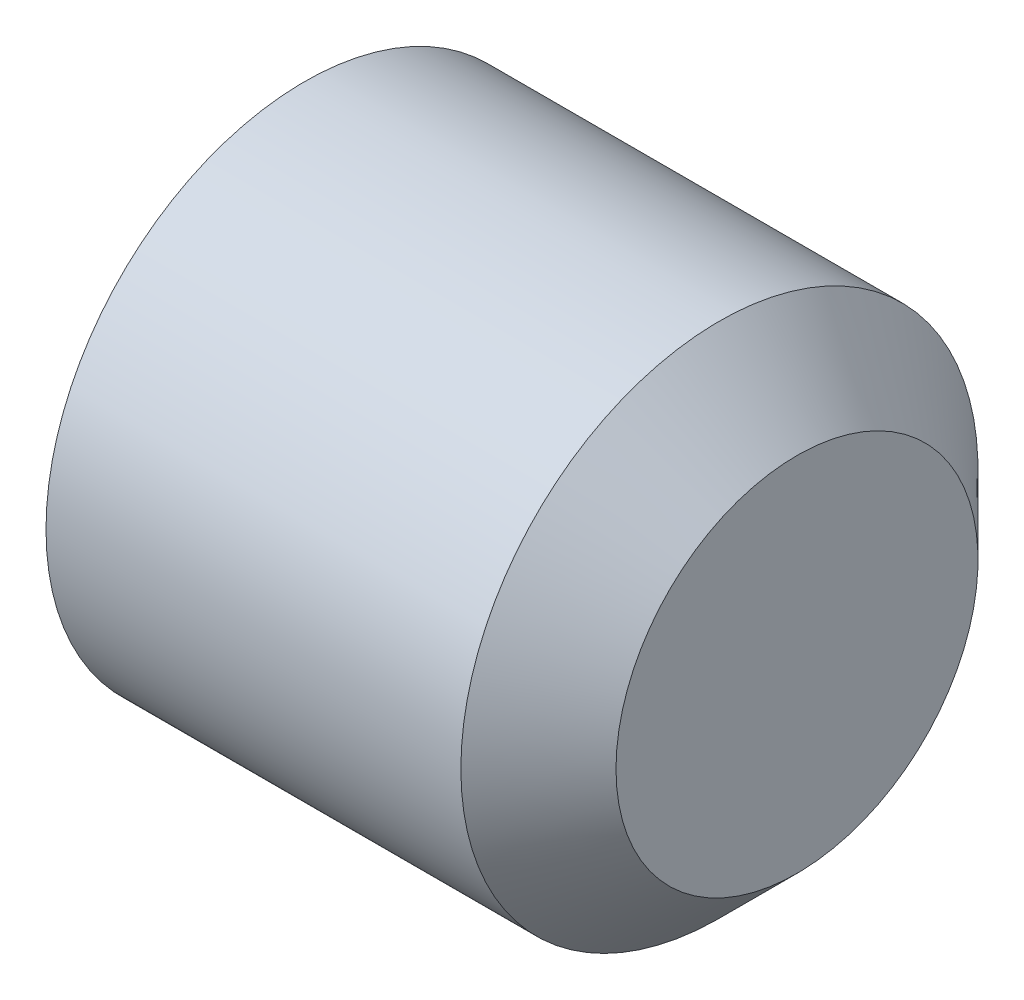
ISO-10303-21;
HEADER;
FILE_DESCRIPTION(('STEP AP214'),'2;1');
FILE_NAME('part.step','',(''),(''),'','','');
FILE_SCHEMA(('AUTOMOTIVE_DESIGN { 1 0 10303 214 1 1 1 1 }'));
ENDSEC;
DATA;
#1=APPLICATION_CONTEXT('core data for automotive mechanical design processes');
#2=APPLICATION_PROTOCOL_DEFINITION('international standard','automotive_design',2000,#1);
#3=PRODUCT_CONTEXT('',#1,'mechanical');
#4=PRODUCT('Part','Part','',(#3));
#5=PRODUCT_RELATED_PRODUCT_CATEGORY('part','',(#4));
#6=PRODUCT_DEFINITION_FORMATION('','',#4);
#7=PRODUCT_DEFINITION_CONTEXT('part definition',#1,'design');
#8=PRODUCT_DEFINITION('design','',#6,#7);
#9=PRODUCT_DEFINITION_SHAPE('','',#8);
#10=(LENGTH_UNIT() NAMED_UNIT(*) SI_UNIT(.MILLI.,.METRE.));
#11=(NAMED_UNIT(*) PLANE_ANGLE_UNIT() SI_UNIT($,.RADIAN.));
#12=(NAMED_UNIT(*) SI_UNIT($,.STERADIAN.) SOLID_ANGLE_UNIT());
#13=UNCERTAINTY_MEASURE_WITH_UNIT(LENGTH_MEASURE(1.E-05),#10,'distance_accuracy_value','');
#14=(GEOMETRIC_REPRESENTATION_CONTEXT(3) GLOBAL_UNCERTAINTY_ASSIGNED_CONTEXT((#13)) GLOBAL_UNIT_ASSIGNED_CONTEXT((#10,
#11,#12)) REPRESENTATION_CONTEXT('',''));
#15=CARTESIAN_POINT('',(0.,0.,0.));
#16=DIRECTION('',(0.,0.,1.));
#17=DIRECTION('',(1.,0.,0.));
#18=AXIS2_PLACEMENT_3D('',#15,#16,#17);
#19=CARTESIAN_POINT('',(0.,0.,0.));
#20=DIRECTION('',(-1.,0.,0.));
#21=DIRECTION('',(0.,0.,1.));
#22=AXIS2_PLACEMENT_3D('',#19,#20,#21);
#23=PLANE('',#22);
#24=CARTESIAN_POINT('',(0.,0.,0.));
#25=DIRECTION('',(-1.,0.,0.));
#26=DIRECTION('',(0.,0.,1.));
#27=AXIS2_PLACEMENT_3D('',#24,#25,#26);
#28=CIRCLE('',#27,4.172);
#29=CARTESIAN_POINT('',(0.,0.,4.17200000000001));
#30=VERTEX_POINT('',#29);
#31=EDGE_CURVE('E87',#30,#30,#28,.T.);
#32=ORIENTED_EDGE('',*,*,#31,.T.);
#33=EDGE_LOOP('',(#32));
#34=FACE_BOUND('',#33,.T.);
#35=DIRECTION('',(0.,0.,-1.));
#36=VECTOR('',#35,1.);
#37=CARTESIAN_POINT('',(0.,2.50000000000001,1.44337567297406));
#38=LINE('',#37,#36);
#39=CARTESIAN_POINT('',(0.,2.50000000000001,1.44337567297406));
#40=VERTEX_POINT('',#39);
#41=CARTESIAN_POINT('',(0.,2.50000000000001,-1.44337567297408));
#42=VERTEX_POINT('',#41);
#43=EDGE_CURVE('E101',#40,#42,#38,.T.);
#44=ORIENTED_EDGE('',*,*,#43,.F.);
#45=DIRECTION('',(0.,-0.866025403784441,0.500000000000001));
#46=VECTOR('',#45,1.);
#47=CARTESIAN_POINT('',(0.,2.50000000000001,1.44337567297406));
#48=LINE('',#47,#46);
#49=CARTESIAN_POINT('',(0.,0.,2.88675134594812));
#50=VERTEX_POINT('',#49);
#51=EDGE_CURVE('E46',#40,#50,#48,.T.);
#52=ORIENTED_EDGE('',*,*,#51,.T.);
#53=DIRECTION('',(0.,0.86602540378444,0.500000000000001));
#54=VECTOR('',#53,1.);
#55=CARTESIAN_POINT('',(0.,-2.5,1.44337567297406));
#56=LINE('',#55,#54);
#57=CARTESIAN_POINT('',(0.,-2.5,1.44337567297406));
#58=VERTEX_POINT('',#57);
#59=EDGE_CURVE('E91',#58,#50,#56,.T.);
#60=ORIENTED_EDGE('',*,*,#59,.F.);
#61=DIRECTION('',(0.,0.,-1.));
#62=VECTOR('',#61,1.);
#63=CARTESIAN_POINT('',(0.,-2.5,1.44337567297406));
#64=LINE('',#63,#62);
#65=CARTESIAN_POINT('',(0.,-2.5,-1.44337567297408));
#66=VERTEX_POINT('',#65);
#67=EDGE_CURVE('E96',#58,#66,#64,.T.);
#68=ORIENTED_EDGE('',*,*,#67,.T.);
#69=DIRECTION('',(0.,0.86602540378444,-0.500000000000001));
#70=VECTOR('',#69,1.);
#71=CARTESIAN_POINT('',(0.,-2.5,-1.44337567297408));
#72=LINE('',#71,#70);
#73=CARTESIAN_POINT('',(0.,0.,-2.88675134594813));
#74=VERTEX_POINT('',#73);
#75=EDGE_CURVE('E105',#66,#74,#72,.T.);
#76=ORIENTED_EDGE('',*,*,#75,.T.);
#77=DIRECTION('',(0.,-0.86602540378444,-0.500000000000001));
#78=VECTOR('',#77,1.);
#79=CARTESIAN_POINT('',(0.,2.50000000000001,-1.44337567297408));
#80=LINE('',#79,#78);
#81=EDGE_CURVE('E108',#42,#74,#80,.T.);
#82=ORIENTED_EDGE('',*,*,#81,.F.);
#83=EDGE_LOOP('',(#44,#52,#60,#68,#76,#82));
#84=FACE_BOUND('',#83,.T.);
#85=ADVANCED_FACE('F31',(#34,#84),#23,.T.);
#86=CARTESIAN_POINT('',(10.,3.5,0.));
#87=DIRECTION('',(1.,0.,0.));
#88=DIRECTION('',(0.,0.,-1.));
#89=AXIS2_PLACEMENT_3D('',#86,#87,#88);
#90=PLANE('',#89);
#91=CARTESIAN_POINT('',(10.,0.,0.));
#92=DIRECTION('',(-1.,0.,0.));
#93=DIRECTION('',(0.,0.,1.));
#94=AXIS2_PLACEMENT_3D('',#91,#92,#93);
#95=CIRCLE('',#94,3.5);
#96=CARTESIAN_POINT('',(10.,0.,3.5));
#97=VERTEX_POINT('',#96);
#98=EDGE_CURVE('E11',#97,#97,#95,.T.);
#99=ORIENTED_EDGE('',*,*,#98,.F.);
#100=EDGE_LOOP('',(#99));
#101=FACE_BOUND('',#100,.T.);
#102=ADVANCED_FACE('F33',(#101),#90,.T.);
#103=CARTESIAN_POINT('',(8.50000000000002,0.,0.));
#104=DIRECTION('',(-1.,0.,0.));
#105=DIRECTION('',(0.,0.,1.));
#106=AXIS2_PLACEMENT_3D('',#103,#104,#105);
#107=CONICAL_SURFACE('',#106,5.,0.785398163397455);
#108=ORIENTED_EDGE('',*,*,#98,.T.);
#109=EDGE_LOOP('',(#108));
#110=FACE_BOUND('',#109,.T.);
#111=CARTESIAN_POINT('',(8.50000000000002,0.,0.));
#112=DIRECTION('',(-1.,0.,0.));
#113=DIRECTION('',(0.,0.,1.));
#114=AXIS2_PLACEMENT_3D('',#111,#112,#113);
#115=CIRCLE('',#114,5.);
#116=CARTESIAN_POINT('',(8.50000000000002,0.,5.));
#117=VERTEX_POINT('',#116);
#118=EDGE_CURVE('E39',#117,#117,#115,.T.);
#119=ORIENTED_EDGE('',*,*,#118,.F.);
#120=EDGE_LOOP('',(#119));
#121=FACE_BOUND('',#120,.T.);
#122=ADVANCED_FACE('F143',(#110,#121),#107,.T.);
#123=CARTESIAN_POINT('',(-12.7,0.,0.));
#124=DIRECTION('',(-1.,0.,0.));
#125=DIRECTION('',(0.,0.,1.));
#126=AXIS2_PLACEMENT_3D('',#123,#124,#125);
#127=CYLINDRICAL_SURFACE('',#126,5.);
#128=ORIENTED_EDGE('',*,*,#118,.T.);
#129=EDGE_LOOP('',(#128));
#130=FACE_BOUND('',#129,.T.);
#131=CARTESIAN_POINT('',(0.478046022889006,0.,0.));
#132=DIRECTION('',(-1.,0.,0.));
#133=DIRECTION('',(0.,0.,1.));
#134=AXIS2_PLACEMENT_3D('',#131,#132,#133);
#135=CIRCLE('',#134,5.);
#136=CARTESIAN_POINT('',(0.478046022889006,0.,5.00000000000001));
#137=VERTEX_POINT('',#136);
#138=EDGE_CURVE('E135',#137,#137,#135,.T.);
#139=ORIENTED_EDGE('',*,*,#138,.F.);
#140=EDGE_LOOP('',(#139));
#141=FACE_BOUND('',#140,.T.);
#142=ADVANCED_FACE('F140',(#130,#141),#127,.T.);
#143=CARTESIAN_POINT('',(0.,0.,0.));
#144=DIRECTION('',(1.,0.,0.));
#145=DIRECTION('',(0.,0.,-1.));
#146=AXIS2_PLACEMENT_3D('',#143,#144,#145);
#147=CONICAL_SURFACE('',#146,4.172,1.0471975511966);
#148=ORIENTED_EDGE('',*,*,#138,.T.);
#149=EDGE_LOOP('',(#148));
#150=FACE_BOUND('',#149,.T.);
#151=ORIENTED_EDGE('',*,*,#31,.F.);
#152=EDGE_LOOP('',(#151));
#153=FACE_BOUND('',#152,.T.);
#154=ADVANCED_FACE('F150',(#150,#153),#147,.T.);
#155=CARTESIAN_POINT('',(5.,2.5,1.44337567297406));
#156=DIRECTION('',(0.,-0.500000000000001,-0.86602540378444));
#157=DIRECTION('',(0.,0.866025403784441,-0.500000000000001));
#158=AXIS2_PLACEMENT_3D('',#155,#156,#157);
#159=PLANE('',#158);
#160=ORIENTED_EDGE('',*,*,#51,.F.);
#161=DIRECTION('',(-1.,0.,0.));
#162=VECTOR('',#161,1.);
#163=CARTESIAN_POINT('',(5.,2.5,1.44337567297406));
#164=LINE('',#163,#162);
#165=CARTESIAN_POINT('',(5.,2.5,1.44337567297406));
#166=VERTEX_POINT('',#165);
#167=EDGE_CURVE('E50',#166,#40,#164,.T.);
#168=ORIENTED_EDGE('',*,*,#167,.F.);
#169=DIRECTION('',(0.,-0.866025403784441,0.500000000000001));
#170=VECTOR('',#169,1.);
#171=CARTESIAN_POINT('',(5.,2.5,1.44337567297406));
#172=LINE('',#171,#170);
#173=CARTESIAN_POINT('',(5.,0.,2.88675134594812));
#174=VERTEX_POINT('',#173);
#175=EDGE_CURVE('E83',#166,#174,#172,.T.);
#176=ORIENTED_EDGE('',*,*,#175,.T.);
#177=DIRECTION('',(-1.,0.,0.));
#178=VECTOR('',#177,1.);
#179=CARTESIAN_POINT('',(5.,0.,2.88675134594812));
#180=LINE('',#179,#178);
#181=EDGE_CURVE('E80',#174,#50,#180,.T.);
#182=ORIENTED_EDGE('',*,*,#181,.T.);
#183=EDGE_LOOP('',(#160,#168,#176,#182));
#184=FACE_BOUND('',#183,.T.);
#185=ADVANCED_FACE('F82',(#184),#159,.T.);
#186=CARTESIAN_POINT('',(5.,-2.50000000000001,1.44337567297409));
#187=DIRECTION('',(0.,-0.500000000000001,0.86602540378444));
#188=DIRECTION('',(0.,-0.86602540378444,-0.500000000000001));
#189=AXIS2_PLACEMENT_3D('',#186,#187,#188);
#190=PLANE('',#189);
#191=ORIENTED_EDGE('',*,*,#59,.T.);
#192=ORIENTED_EDGE('',*,*,#181,.F.);
#193=DIRECTION('',(0.,0.86602540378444,0.500000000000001));
#194=VECTOR('',#193,1.);
#195=CARTESIAN_POINT('',(5.,-2.50000000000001,1.44337567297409));
#196=LINE('',#195,#194);
#197=CARTESIAN_POINT('',(5.,-2.50000000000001,1.44337567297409));
#198=VERTEX_POINT('',#197);
#199=EDGE_CURVE('E113',#198,#174,#196,.T.);
#200=ORIENTED_EDGE('',*,*,#199,.F.);
#201=DIRECTION('',(-1.,0.,0.));
#202=VECTOR('',#201,1.);
#203=CARTESIAN_POINT('',(5.,-2.50000000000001,1.44337567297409));
#204=LINE('',#203,#202);
#205=EDGE_CURVE('E88',#198,#58,#204,.T.);
#206=ORIENTED_EDGE('',*,*,#205,.T.);
#207=EDGE_LOOP('',(#191,#192,#200,#206));
#208=FACE_BOUND('',#207,.T.);
#209=ADVANCED_FACE('F92',(#208),#190,.F.);
#210=CARTESIAN_POINT('',(5.,-2.50000000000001,1.44337567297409));
#211=DIRECTION('',(0.,1.,0.));
#212=DIRECTION('',(0.,0.,1.));
#213=AXIS2_PLACEMENT_3D('',#210,#211,#212);
#214=PLANE('',#213);
#215=ORIENTED_EDGE('',*,*,#67,.F.);
#216=ORIENTED_EDGE('',*,*,#205,.F.);
#217=DIRECTION('',(0.,0.,-1.));
#218=VECTOR('',#217,1.);
#219=CARTESIAN_POINT('',(5.,-2.50000000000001,1.44337567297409));
#220=LINE('',#219,#218);
#221=CARTESIAN_POINT('',(4.99999999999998,-2.50000000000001,-1.44337567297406));
#222=VERTEX_POINT('',#221);
#223=EDGE_CURVE('E115',#198,#222,#220,.T.);
#224=ORIENTED_EDGE('',*,*,#223,.T.);
#225=DIRECTION('',(-1.,0.,0.));
#226=VECTOR('',#225,1.);
#227=CARTESIAN_POINT('',(4.99999999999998,-2.50000000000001,-1.44337567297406));
#228=LINE('',#227,#226);
#229=EDGE_CURVE('E130',#222,#66,#228,.T.);
#230=ORIENTED_EDGE('',*,*,#229,.T.);
#231=EDGE_LOOP('',(#215,#216,#224,#230));
#232=FACE_BOUND('',#231,.T.);
#233=ADVANCED_FACE('F172',(#232),#214,.T.);
#234=CARTESIAN_POINT('',(4.99999999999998,-2.50000000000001,-1.44337567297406));
#235=DIRECTION('',(0.,0.500000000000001,0.86602540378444));
#236=DIRECTION('',(0.,-0.86602540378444,0.500000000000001));
#237=AXIS2_PLACEMENT_3D('',#234,#235,#236);
#238=PLANE('',#237);
#239=ORIENTED_EDGE('',*,*,#75,.F.);
#240=ORIENTED_EDGE('',*,*,#229,.F.);
#241=DIRECTION('',(0.,0.86602540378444,-0.500000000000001));
#242=VECTOR('',#241,1.);
#243=CARTESIAN_POINT('',(4.99999999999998,-2.50000000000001,-1.44337567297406));
#244=LINE('',#243,#242);
#245=CARTESIAN_POINT('',(4.99999999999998,0.,-2.88675134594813));
#246=VERTEX_POINT('',#245);
#247=EDGE_CURVE('E117',#222,#246,#244,.T.);
#248=ORIENTED_EDGE('',*,*,#247,.T.);
#249=DIRECTION('',(-1.,0.,0.));
#250=VECTOR('',#249,1.);
#251=CARTESIAN_POINT('',(4.99999999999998,0.,-2.88675134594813));
#252=LINE('',#251,#250);
#253=EDGE_CURVE('E128',#246,#74,#252,.T.);
#254=ORIENTED_EDGE('',*,*,#253,.T.);
#255=EDGE_LOOP('',(#239,#240,#248,#254));
#256=FACE_BOUND('',#255,.T.);
#257=ADVANCED_FACE('F176',(#256),#238,.T.);
#258=CARTESIAN_POINT('',(4.99999999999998,2.5,-1.44337567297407));
#259=DIRECTION('',(0.,0.500000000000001,-0.86602540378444));
#260=DIRECTION('',(0.,0.86602540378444,0.500000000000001));
#261=AXIS2_PLACEMENT_3D('',#258,#259,#260);
#262=PLANE('',#261);
#263=ORIENTED_EDGE('',*,*,#81,.T.);
#264=ORIENTED_EDGE('',*,*,#253,.F.);
#265=DIRECTION('',(0.,-0.86602540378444,-0.500000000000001));
#266=VECTOR('',#265,1.);
#267=CARTESIAN_POINT('',(4.99999999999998,2.5,-1.44337567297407));
#268=LINE('',#267,#266);
#269=CARTESIAN_POINT('',(4.99999999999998,2.5,-1.44337567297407));
#270=VERTEX_POINT('',#269);
#271=EDGE_CURVE('E119',#270,#246,#268,.T.);
#272=ORIENTED_EDGE('',*,*,#271,.F.);
#273=DIRECTION('',(-1.,0.,0.));
#274=VECTOR('',#273,1.);
#275=CARTESIAN_POINT('',(4.99999999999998,2.5,-1.44337567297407));
#276=LINE('',#275,#274);
#277=EDGE_CURVE('E126',#270,#42,#276,.T.);
#278=ORIENTED_EDGE('',*,*,#277,.T.);
#279=EDGE_LOOP('',(#263,#264,#272,#278));
#280=FACE_BOUND('',#279,.T.);
#281=ADVANCED_FACE('F182',(#280),#262,.F.);
#282=CARTESIAN_POINT('',(5.,2.5,1.44337567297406));
#283=DIRECTION('',(0.,1.,0.));
#284=DIRECTION('',(0.,0.,1.));
#285=AXIS2_PLACEMENT_3D('',#282,#283,#284);
#286=PLANE('',#285);
#287=ORIENTED_EDGE('',*,*,#43,.T.);
#288=ORIENTED_EDGE('',*,*,#277,.F.);
#289=DIRECTION('',(0.,0.,-1.));
#290=VECTOR('',#289,1.);
#291=CARTESIAN_POINT('',(5.,2.5,1.44337567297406));
#292=LINE('',#291,#290);
#293=EDGE_CURVE('E122',#166,#270,#292,.T.);
#294=ORIENTED_EDGE('',*,*,#293,.F.);
#295=ORIENTED_EDGE('',*,*,#167,.T.);
#296=EDGE_LOOP('',(#287,#288,#294,#295));
#297=FACE_BOUND('',#296,.T.);
#298=ADVANCED_FACE('F186',(#297),#286,.F.);
#299=CARTESIAN_POINT('',(5.,2.5,1.44337567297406));
#300=DIRECTION('',(1.,0.,0.));
#301=DIRECTION('',(0.,0.,-1.));
#302=AXIS2_PLACEMENT_3D('',#299,#300,#301);
#303=PLANE('',#302);
#304=ORIENTED_EDGE('',*,*,#175,.F.);
#305=ORIENTED_EDGE('',*,*,#293,.T.);
#306=ORIENTED_EDGE('',*,*,#271,.T.);
#307=ORIENTED_EDGE('',*,*,#247,.F.);
#308=ORIENTED_EDGE('',*,*,#223,.F.);
#309=ORIENTED_EDGE('',*,*,#199,.T.);
#310=EDGE_LOOP('',(#304,#305,#306,#307,#308,#309));
#311=FACE_BOUND('',#310,.T.);
#312=ADVANCED_FACE('F190',(#311),#303,.F.);
#313=CLOSED_SHELL('',(#85,#102,#122,#142,#154,#185,#209,#233,#257,#281,#298,#312));
#314=MANIFOLD_SOLID_BREP('B2',#313);
#315=ADVANCED_BREP_SHAPE_REPRESENTATION('',(#18,#314),#14);
#316=SHAPE_DEFINITION_REPRESENTATION(#9,#315);
ENDSEC;
END-ISO-10303-21;
